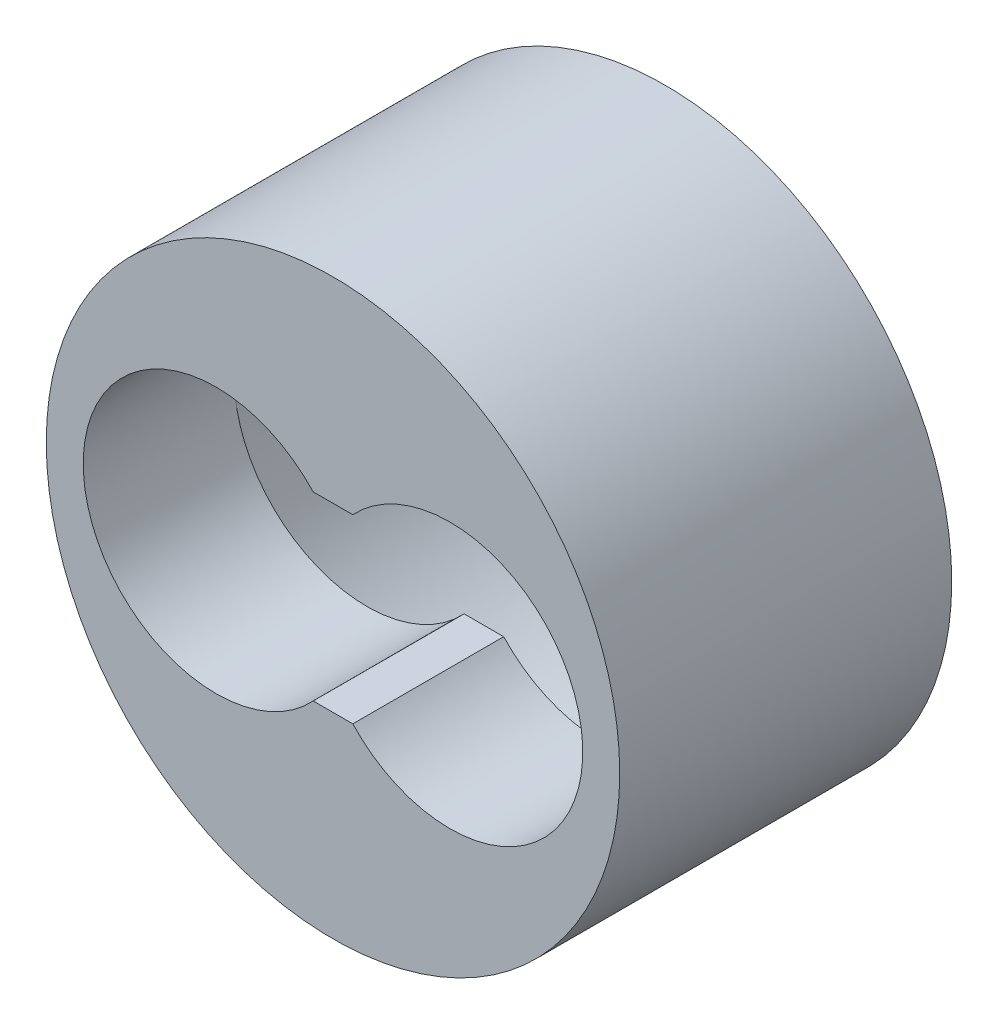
ISO-10303-21;
HEADER;
FILE_DESCRIPTION(('STEP AP214'),'2;1');
FILE_NAME('part.step','',(''),(''),'','','');
FILE_SCHEMA(('AUTOMOTIVE_DESIGN { 1 0 10303 214 1 1 1 1 }'));
ENDSEC;
DATA;
#1=APPLICATION_CONTEXT('core data for automotive mechanical design processes');
#2=APPLICATION_PROTOCOL_DEFINITION('international standard','automotive_design',2000,#1);
#3=PRODUCT_CONTEXT('',#1,'mechanical');
#4=PRODUCT('Part','Part','',(#3));
#5=PRODUCT_RELATED_PRODUCT_CATEGORY('part','',(#4));
#6=PRODUCT_DEFINITION_FORMATION('','',#4);
#7=PRODUCT_DEFINITION_CONTEXT('part definition',#1,'design');
#8=PRODUCT_DEFINITION('design','',#6,#7);
#9=PRODUCT_DEFINITION_SHAPE('','',#8);
#10=(LENGTH_UNIT() NAMED_UNIT(*) SI_UNIT(.MILLI.,.METRE.));
#11=(NAMED_UNIT(*) PLANE_ANGLE_UNIT() SI_UNIT($,.RADIAN.));
#12=(NAMED_UNIT(*) SI_UNIT($,.STERADIAN.) SOLID_ANGLE_UNIT());
#13=UNCERTAINTY_MEASURE_WITH_UNIT(LENGTH_MEASURE(1.E-05),#10,'distance_accuracy_value','');
#14=(GEOMETRIC_REPRESENTATION_CONTEXT(3) GLOBAL_UNCERTAINTY_ASSIGNED_CONTEXT((#13)) GLOBAL_UNIT_ASSIGNED_CONTEXT((#10,
#11,#12)) REPRESENTATION_CONTEXT('',''));
#15=CARTESIAN_POINT('',(0.,0.,0.));
#16=DIRECTION('',(0.,0.,1.));
#17=DIRECTION('',(1.,0.,0.));
#18=AXIS2_PLACEMENT_3D('',#15,#16,#17);
#19=CARTESIAN_POINT('',(0.,0.,0.));
#20=DIRECTION('',(0.,0.,1.));
#21=DIRECTION('',(1.,0.,0.));
#22=AXIS2_PLACEMENT_3D('',#19,#20,#21);
#23=PLANE('',#22);
#24=DIRECTION('',(-1.,0.,0.));
#25=VECTOR('',#24,1.);
#26=CARTESIAN_POINT('',(-1.5,3.,0.));
#27=LINE('',#26,#25);
#28=CARTESIAN_POINT('',(0.656304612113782,3.,0.));
#29=VERTEX_POINT('',#28);
#30=CARTESIAN_POINT('',(-0.656304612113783,3.,0.));
#31=VERTEX_POINT('',#30);
#32=EDGE_CURVE('E110',#29,#31,#27,.T.);
#33=ORIENTED_EDGE('',*,*,#32,.T.);
#34=CARTESIAN_POINT('',(-3.875,0.,0.));
#35=DIRECTION('',(0.,0.,1.));
#36=DIRECTION('',(1.,0.,0.));
#37=AXIS2_PLACEMENT_3D('',#34,#35,#36);
#38=CIRCLE('',#37,4.4);
#39=CARTESIAN_POINT('',(-8.275,0.,0.));
#40=VERTEX_POINT('',#39);
#41=EDGE_CURVE('E121',#31,#40,#38,.T.);
#42=ORIENTED_EDGE('',*,*,#41,.T.);
#43=CARTESIAN_POINT('',(0.,0.,0.));
#44=DIRECTION('',(0.,0.,1.));
#45=DIRECTION('',(1.,0.,0.));
#46=AXIS2_PLACEMENT_3D('',#43,#44,#45);
#47=CIRCLE('',#46,8.275);
#48=CARTESIAN_POINT('',(8.275,0.,0.));
#49=VERTEX_POINT('',#48);
#50=EDGE_CURVE('E99',#49,#40,#47,.T.);
#51=ORIENTED_EDGE('',*,*,#50,.F.);
#52=CARTESIAN_POINT('',(3.875,0.,0.));
#53=DIRECTION('',(0.,0.,1.));
#54=DIRECTION('',(1.,0.,0.));
#55=AXIS2_PLACEMENT_3D('',#52,#53,#54);
#56=CIRCLE('',#55,4.4);
#57=EDGE_CURVE('E115',#49,#29,#56,.T.);
#58=ORIENTED_EDGE('',*,*,#57,.T.);
#59=EDGE_LOOP('',(#33,#42,#51,#58));
#60=FACE_BOUND('',#59,.T.);
#61=ADVANCED_FACE('F45',(#60),#23,.F.);
#62=DIRECTION('',(1.,0.,0.));
#63=VECTOR('',#62,1.);
#64=CARTESIAN_POINT('',(-1.5,-3.,0.));
#65=LINE('',#64,#63);
#66=CARTESIAN_POINT('',(-0.656304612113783,-3.,0.));
#67=VERTEX_POINT('',#66);
#68=CARTESIAN_POINT('',(0.656304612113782,-3.,0.));
#69=VERTEX_POINT('',#68);
#70=EDGE_CURVE('E61',#67,#69,#65,.T.);
#71=ORIENTED_EDGE('',*,*,#70,.T.);
#72=EDGE_CURVE('E105',#69,#49,#56,.T.);
#73=ORIENTED_EDGE('',*,*,#72,.T.);
#74=EDGE_CURVE('E133',#40,#49,#47,.T.);
#75=ORIENTED_EDGE('',*,*,#74,.F.);
#76=EDGE_CURVE('E108',#40,#67,#38,.T.);
#77=ORIENTED_EDGE('',*,*,#76,.T.);
#78=EDGE_LOOP('',(#71,#73,#75,#77));
#79=FACE_BOUND('',#78,.T.);
#80=ADVANCED_FACE('F103',(#79),#23,.F.);
#81=CARTESIAN_POINT('',(0.,0.,5.));
#82=DIRECTION('',(0.,0.,1.));
#83=DIRECTION('',(1.,0.,0.));
#84=AXIS2_PLACEMENT_3D('',#81,#82,#83);
#85=PLANE('',#84);
#86=CARTESIAN_POINT('',(0.,0.,5.));
#87=DIRECTION('',(0.,0.,1.));
#88=DIRECTION('',(1.,0.,0.));
#89=AXIS2_PLACEMENT_3D('',#86,#87,#88);
#90=CIRCLE('',#89,9.5);
#91=CARTESIAN_POINT('',(9.5,0.,5.));
#92=VERTEX_POINT('',#91);
#93=EDGE_CURVE('E130',#92,#92,#90,.T.);
#94=ORIENTED_EDGE('',*,*,#93,.T.);
#95=EDGE_LOOP('',(#94));
#96=FACE_BOUND('',#95,.T.);
#97=CARTESIAN_POINT('',(3.875,0.,5.));
#98=DIRECTION('',(0.,0.,1.));
#99=DIRECTION('',(1.,0.,0.));
#100=AXIS2_PLACEMENT_3D('',#97,#98,#99);
#101=CIRCLE('',#100,4.4);
#102=CARTESIAN_POINT('',(0.656304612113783,-3.,5.));
#103=VERTEX_POINT('',#102);
#104=CARTESIAN_POINT('',(0.656304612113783,3.,5.));
#105=VERTEX_POINT('',#104);
#106=EDGE_CURVE('E129',#103,#105,#101,.T.);
#107=ORIENTED_EDGE('',*,*,#106,.F.);
#108=DIRECTION('',(-1.,0.,0.));
#109=VECTOR('',#108,1.);
#110=CARTESIAN_POINT('',(0.,-3.,5.));
#111=LINE('',#110,#109);
#112=CARTESIAN_POINT('',(-0.656304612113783,-3.,5.));
#113=VERTEX_POINT('',#112);
#114=EDGE_CURVE('E93',#103,#113,#111,.T.);
#115=ORIENTED_EDGE('',*,*,#114,.T.);
#116=CARTESIAN_POINT('',(-3.875,0.,5.));
#117=DIRECTION('',(0.,0.,1.));
#118=DIRECTION('',(1.,0.,0.));
#119=AXIS2_PLACEMENT_3D('',#116,#117,#118);
#120=CIRCLE('',#119,4.4);
#121=CARTESIAN_POINT('',(-0.656304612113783,3.,5.));
#122=VERTEX_POINT('',#121);
#123=EDGE_CURVE('E125',#122,#113,#120,.T.);
#124=ORIENTED_EDGE('',*,*,#123,.F.);
#125=DIRECTION('',(1.,0.,0.));
#126=VECTOR('',#125,1.);
#127=CARTESIAN_POINT('',(0.,3.,5.));
#128=LINE('',#127,#126);
#129=EDGE_CURVE('E68',#122,#105,#128,.T.);
#130=ORIENTED_EDGE('',*,*,#129,.T.);
#131=EDGE_LOOP('',(#107,#115,#124,#130));
#132=FACE_BOUND('',#131,.T.);
#133=ADVANCED_FACE('F167',(#96,#132),#85,.T.);
#134=CARTESIAN_POINT('',(3.875,0.,5.));
#135=DIRECTION('',(0.,0.,-1.));
#136=DIRECTION('',(-1.,0.,0.));
#137=AXIS2_PLACEMENT_3D('',#134,#135,#136);
#138=CYLINDRICAL_SURFACE('',#137,4.4);
#139=ORIENTED_EDGE('',*,*,#72,.F.);
#140=DIRECTION('',(0.,0.,-1.));
#141=VECTOR('',#140,1.);
#142=CARTESIAN_POINT('',(0.656304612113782,-3.,5.));
#143=LINE('',#142,#141);
#144=EDGE_CURVE('E90',#69,#103,#143,.F.);
#145=ORIENTED_EDGE('',*,*,#144,.T.);
#146=ORIENTED_EDGE('',*,*,#106,.T.);
#147=DIRECTION('',(0.,0.,-1.));
#148=VECTOR('',#147,1.);
#149=CARTESIAN_POINT('',(0.656304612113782,3.,5.));
#150=LINE('',#149,#148);
#151=EDGE_CURVE('E157',#105,#29,#150,.T.);
#152=ORIENTED_EDGE('',*,*,#151,.T.);
#153=ORIENTED_EDGE('',*,*,#57,.F.);
#154=EDGE_LOOP('',(#139,#145,#146,#152,#153));
#155=FACE_BOUND('',#154,.T.);
#156=ADVANCED_FACE('F112',(#155),#138,.F.);
#157=CARTESIAN_POINT('',(-3.875,0.,5.));
#158=DIRECTION('',(0.,0.,-1.));
#159=DIRECTION('',(-1.,0.,0.));
#160=AXIS2_PLACEMENT_3D('',#157,#158,#159);
#161=CYLINDRICAL_SURFACE('',#160,4.4);
#162=ORIENTED_EDGE('',*,*,#123,.T.);
#163=DIRECTION('',(0.,0.,-1.));
#164=VECTOR('',#163,1.);
#165=CARTESIAN_POINT('',(-0.656304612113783,-3.,5.));
#166=LINE('',#165,#164);
#167=EDGE_CURVE('E11',#113,#67,#166,.T.);
#168=ORIENTED_EDGE('',*,*,#167,.T.);
#169=ORIENTED_EDGE('',*,*,#76,.F.);
#170=ORIENTED_EDGE('',*,*,#41,.F.);
#171=DIRECTION('',(0.,0.,-1.));
#172=VECTOR('',#171,1.);
#173=CARTESIAN_POINT('',(-0.656304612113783,3.,5.));
#174=LINE('',#173,#172);
#175=EDGE_CURVE('E54',#31,#122,#174,.F.);
#176=ORIENTED_EDGE('',*,*,#175,.T.);
#177=EDGE_LOOP('',(#162,#168,#169,#170,#176));
#178=FACE_BOUND('',#177,.T.);
#179=ADVANCED_FACE('F165',(#178),#161,.F.);
#180=CARTESIAN_POINT('',(0.,0.,5.));
#181=DIRECTION('',(0.,0.,-1.));
#182=DIRECTION('',(-1.,0.,0.));
#183=AXIS2_PLACEMENT_3D('',#180,#181,#182);
#184=CYLINDRICAL_SURFACE('',#183,9.5);
#185=ORIENTED_EDGE('',*,*,#93,.F.);
#186=EDGE_LOOP('',(#185));
#187=FACE_BOUND('',#186,.T.);
#188=CARTESIAN_POINT('',(0.,0.,-6.));
#189=DIRECTION('',(0.,0.,1.));
#190=DIRECTION('',(1.,0.,0.));
#191=AXIS2_PLACEMENT_3D('',#188,#189,#190);
#192=CIRCLE('',#191,9.5);
#193=CARTESIAN_POINT('',(9.5,0.,-6.));
#194=VERTEX_POINT('',#193);
#195=EDGE_CURVE('E123',#194,#194,#192,.T.);
#196=ORIENTED_EDGE('',*,*,#195,.T.);
#197=EDGE_LOOP('',(#196));
#198=FACE_BOUND('',#197,.T.);
#199=ADVANCED_FACE('F47',(#187,#198),#184,.T.);
#200=CARTESIAN_POINT('',(0.,0.,-6.));
#201=DIRECTION('',(0.,0.,1.));
#202=DIRECTION('',(1.,0.,0.));
#203=AXIS2_PLACEMENT_3D('',#200,#201,#202);
#204=PLANE('',#203);
#205=CARTESIAN_POINT('',(0.,0.,-6.));
#206=DIRECTION('',(0.,0.,1.));
#207=DIRECTION('',(1.,0.,0.));
#208=AXIS2_PLACEMENT_3D('',#205,#206,#207);
#209=CIRCLE('',#208,8.275);
#210=CARTESIAN_POINT('',(8.275,0.,-6.));
#211=VERTEX_POINT('',#210);
#212=EDGE_CURVE('E147',#211,#211,#209,.T.);
#213=ORIENTED_EDGE('',*,*,#212,.T.);
#214=EDGE_LOOP('',(#213));
#215=FACE_BOUND('',#214,.T.);
#216=ORIENTED_EDGE('',*,*,#195,.F.);
#217=EDGE_LOOP('',(#216));
#218=FACE_BOUND('',#217,.T.);
#219=ADVANCED_FACE('F180',(#215,#218),#204,.F.);
#220=CARTESIAN_POINT('',(0.,0.,-6.));
#221=DIRECTION('',(0.,0.,1.));
#222=DIRECTION('',(1.,0.,0.));
#223=AXIS2_PLACEMENT_3D('',#220,#221,#222);
#224=CYLINDRICAL_SURFACE('',#223,8.275);
#225=ORIENTED_EDGE('',*,*,#212,.F.);
#226=EDGE_LOOP('',(#225));
#227=FACE_BOUND('',#226,.T.);
#228=ORIENTED_EDGE('',*,*,#50,.T.);
#229=ORIENTED_EDGE('',*,*,#74,.T.);
#230=EDGE_LOOP('',(#228,#229));
#231=FACE_BOUND('',#230,.T.);
#232=ADVANCED_FACE('F172',(#227,#231),#224,.F.);
#233=CARTESIAN_POINT('',(-1.5,3.,10.));
#234=DIRECTION('',(0.,-1.,0.));
#235=DIRECTION('',(1.,0.,0.));
#236=AXIS2_PLACEMENT_3D('',#233,#234,#235);
#237=PLANE('',#236);
#238=ORIENTED_EDGE('',*,*,#129,.F.);
#239=ORIENTED_EDGE('',*,*,#175,.F.);
#240=ORIENTED_EDGE('',*,*,#32,.F.);
#241=ORIENTED_EDGE('',*,*,#151,.F.);
#242=EDGE_LOOP('',(#238,#239,#240,#241));
#243=FACE_BOUND('',#242,.T.);
#244=ADVANCED_FACE('F170',(#243),#237,.T.);
#245=CARTESIAN_POINT('',(-1.5,-3.,10.));
#246=DIRECTION('',(0.,1.,0.));
#247=DIRECTION('',(-1.,0.,0.));
#248=AXIS2_PLACEMENT_3D('',#245,#246,#247);
#249=PLANE('',#248);
#250=ORIENTED_EDGE('',*,*,#70,.F.);
#251=ORIENTED_EDGE('',*,*,#167,.F.);
#252=ORIENTED_EDGE('',*,*,#114,.F.);
#253=ORIENTED_EDGE('',*,*,#144,.F.);
#254=EDGE_LOOP('',(#250,#251,#252,#253));
#255=FACE_BOUND('',#254,.T.);
#256=ADVANCED_FACE('F91',(#255),#249,.T.);
#257=CLOSED_SHELL('',(#61,#80,#133,#156,#179,#199,#219,#232,#244,#256));
#258=MANIFOLD_SOLID_BREP('B2',#257);
#259=ADVANCED_BREP_SHAPE_REPRESENTATION('',(#18,#258),#14);
#260=SHAPE_DEFINITION_REPRESENTATION(#9,#259);
ENDSEC;
END-ISO-10303-21;
